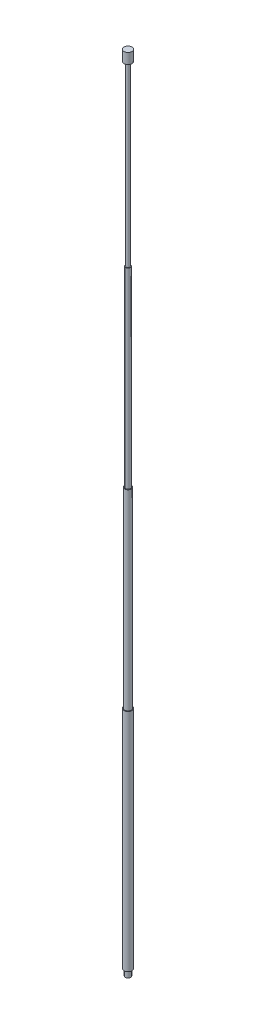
ISO-10303-21;
HEADER;
FILE_DESCRIPTION(('STEP AP214'),'2;1');
FILE_NAME('part.step','',(''),(''),'','','');
FILE_SCHEMA(('AUTOMOTIVE_DESIGN { 1 0 10303 214 1 1 1 1 }'));
ENDSEC;
DATA;
#1=APPLICATION_CONTEXT('core data for automotive mechanical design processes');
#2=APPLICATION_PROTOCOL_DEFINITION('international standard','automotive_design',2000,#1);
#3=PRODUCT_CONTEXT('',#1,'mechanical');
#4=PRODUCT('Part','Part','',(#3));
#5=PRODUCT_RELATED_PRODUCT_CATEGORY('part','',(#4));
#6=PRODUCT_DEFINITION_FORMATION('','',#4);
#7=PRODUCT_DEFINITION_CONTEXT('part definition',#1,'design');
#8=PRODUCT_DEFINITION('design','',#6,#7);
#9=PRODUCT_DEFINITION_SHAPE('','',#8);
#10=(LENGTH_UNIT() NAMED_UNIT(*) SI_UNIT(.MILLI.,.METRE.));
#11=(NAMED_UNIT(*) PLANE_ANGLE_UNIT() SI_UNIT($,.RADIAN.));
#12=(NAMED_UNIT(*) SI_UNIT($,.STERADIAN.) SOLID_ANGLE_UNIT());
#13=UNCERTAINTY_MEASURE_WITH_UNIT(LENGTH_MEASURE(1.E-05),#10,'distance_accuracy_value','');
#14=(GEOMETRIC_REPRESENTATION_CONTEXT(3) GLOBAL_UNCERTAINTY_ASSIGNED_CONTEXT((#13)) GLOBAL_UNIT_ASSIGNED_CONTEXT((#10,
#11,#12)) REPRESENTATION_CONTEXT('',''));
#15=CARTESIAN_POINT('',(0.,0.,0.));
#16=DIRECTION('',(0.,0.,1.));
#17=DIRECTION('',(1.,0.,0.));
#18=AXIS2_PLACEMENT_3D('',#15,#16,#17);
#19=CARTESIAN_POINT('',(0.,0.,0.));
#20=DIRECTION('',(0.,1.,0.));
#21=DIRECTION('',(0.,0.,1.));
#22=AXIS2_PLACEMENT_3D('',#19,#20,#21);
#23=PLANE('',#22);
#24=CARTESIAN_POINT('',(0.,0.,0.));
#25=DIRECTION('',(0.,1.,0.));
#26=DIRECTION('',(0.,0.,1.));
#27=AXIS2_PLACEMENT_3D('',#24,#25,#26);
#28=CIRCLE('',#27,2.125);
#29=CARTESIAN_POINT('',(0.,0.,2.125));
#30=VERTEX_POINT('',#29);
#31=EDGE_CURVE('E40',#30,#30,#28,.T.);
#32=ORIENTED_EDGE('',*,*,#31,.F.);
#33=EDGE_LOOP('',(#32));
#34=FACE_BOUND('',#33,.T.);
#35=CARTESIAN_POINT('',(0.,0.,0.));
#36=DIRECTION('',(0.,1.,0.));
#37=DIRECTION('',(0.,0.,1.));
#38=AXIS2_PLACEMENT_3D('',#35,#36,#37);
#39=CIRCLE('',#38,1.435);
#40=CARTESIAN_POINT('',(0.,0.,1.435));
#41=VERTEX_POINT('',#40);
#42=EDGE_CURVE('E10',#41,#41,#39,.F.);
#43=ORIENTED_EDGE('',*,*,#42,.F.);
#44=EDGE_LOOP('',(#43));
#45=FACE_BOUND('',#44,.T.);
#46=ADVANCED_FACE('F25',(#34,#45),#23,.F.);
#47=CARTESIAN_POINT('',(0.,424.,0.));
#48=DIRECTION('',(0.,-1.,0.));
#49=DIRECTION('',(0.,0.,-1.));
#50=AXIS2_PLACEMENT_3D('',#47,#48,#49);
#51=CYLINDRICAL_SURFACE('',#50,0.925);
#52=CARTESIAN_POINT('',(0.,324.,0.));
#53=DIRECTION('',(0.,1.,0.));
#54=DIRECTION('',(0.,0.,1.));
#55=AXIS2_PLACEMENT_3D('',#52,#53,#54);
#56=CIRCLE('',#55,0.925);
#57=CARTESIAN_POINT('',(0.,324.,0.925));
#58=VERTEX_POINT('',#57);
#59=EDGE_CURVE('E57',#58,#58,#56,.T.);
#60=ORIENTED_EDGE('',*,*,#59,.T.);
#61=EDGE_LOOP('',(#60));
#62=FACE_BOUND('',#61,.T.);
#63=CARTESIAN_POINT('',(0.,418.4,0.));
#64=DIRECTION('',(0.,1.,0.));
#65=DIRECTION('',(0.,0.,1.));
#66=AXIS2_PLACEMENT_3D('',#63,#64,#65);
#67=CIRCLE('',#66,0.925);
#68=CARTESIAN_POINT('',(0.,418.4,0.925));
#69=VERTEX_POINT('',#68);
#70=EDGE_CURVE('E32',#69,#69,#67,.T.);
#71=ORIENTED_EDGE('',*,*,#70,.F.);
#72=EDGE_LOOP('',(#71));
#73=FACE_BOUND('',#72,.T.);
#74=ADVANCED_FACE('F86',(#62,#73),#51,.T.);
#75=CARTESIAN_POINT('',(0.,324.,0.));
#76=DIRECTION('',(0.,1.,0.));
#77=DIRECTION('',(0.,0.,1.));
#78=AXIS2_PLACEMENT_3D('',#75,#76,#77);
#79=PLANE('',#78);
#80=CARTESIAN_POINT('',(0.,324.,0.));
#81=DIRECTION('',(0.,1.,0.));
#82=DIRECTION('',(0.,0.,1.));
#83=AXIS2_PLACEMENT_3D('',#80,#81,#82);
#84=CIRCLE('',#83,1.325);
#85=CARTESIAN_POINT('',(0.,324.,1.325));
#86=VERTEX_POINT('',#85);
#87=EDGE_CURVE('E51',#86,#86,#84,.T.);
#88=ORIENTED_EDGE('',*,*,#87,.T.);
#89=EDGE_LOOP('',(#88));
#90=FACE_BOUND('',#89,.T.);
#91=ORIENTED_EDGE('',*,*,#59,.F.);
#92=EDGE_LOOP('',(#91));
#93=FACE_BOUND('',#92,.T.);
#94=ADVANCED_FACE('F92',(#90,#93),#79,.T.);
#95=CARTESIAN_POINT('',(0.,222.,0.));
#96=DIRECTION('',(0.,1.,0.));
#97=DIRECTION('',(0.,0.,1.));
#98=AXIS2_PLACEMENT_3D('',#95,#96,#97);
#99=PLANE('',#98);
#100=CARTESIAN_POINT('',(0.,222.,0.));
#101=DIRECTION('',(0.,1.,0.));
#102=DIRECTION('',(0.,0.,1.));
#103=AXIS2_PLACEMENT_3D('',#100,#101,#102);
#104=CIRCLE('',#103,1.725);
#105=CARTESIAN_POINT('',(0.,222.,1.725));
#106=VERTEX_POINT('',#105);
#107=EDGE_CURVE('E45',#106,#106,#104,.T.);
#108=ORIENTED_EDGE('',*,*,#107,.T.);
#109=EDGE_LOOP('',(#108));
#110=FACE_BOUND('',#109,.T.);
#111=CARTESIAN_POINT('',(0.,222.,0.));
#112=DIRECTION('',(0.,1.,0.));
#113=DIRECTION('',(0.,0.,1.));
#114=AXIS2_PLACEMENT_3D('',#111,#112,#113);
#115=CIRCLE('',#114,1.325);
#116=CARTESIAN_POINT('',(0.,222.,1.325));
#117=VERTEX_POINT('',#116);
#118=EDGE_CURVE('E54',#117,#117,#115,.T.);
#119=ORIENTED_EDGE('',*,*,#118,.F.);
#120=EDGE_LOOP('',(#119));
#121=FACE_BOUND('',#120,.T.);
#122=ADVANCED_FACE('F102',(#110,#121),#99,.T.);
#123=CARTESIAN_POINT('',(0.,120.,0.));
#124=DIRECTION('',(0.,1.,0.));
#125=DIRECTION('',(0.,0.,1.));
#126=AXIS2_PLACEMENT_3D('',#123,#124,#125);
#127=PLANE('',#126);
#128=CARTESIAN_POINT('',(0.,120.,0.));
#129=DIRECTION('',(0.,1.,0.));
#130=DIRECTION('',(0.,0.,1.));
#131=AXIS2_PLACEMENT_3D('',#128,#129,#130);
#132=CIRCLE('',#131,2.125);
#133=CARTESIAN_POINT('',(0.,120.,2.125));
#134=VERTEX_POINT('',#133);
#135=EDGE_CURVE('E36',#134,#134,#132,.T.);
#136=ORIENTED_EDGE('',*,*,#135,.T.);
#137=EDGE_LOOP('',(#136));
#138=FACE_BOUND('',#137,.T.);
#139=CARTESIAN_POINT('',(0.,120.,0.));
#140=DIRECTION('',(0.,1.,0.));
#141=DIRECTION('',(0.,0.,1.));
#142=AXIS2_PLACEMENT_3D('',#139,#140,#141);
#143=CIRCLE('',#142,1.725);
#144=CARTESIAN_POINT('',(0.,120.,1.725));
#145=VERTEX_POINT('',#144);
#146=EDGE_CURVE('E48',#145,#145,#143,.T.);
#147=ORIENTED_EDGE('',*,*,#146,.F.);
#148=EDGE_LOOP('',(#147));
#149=FACE_BOUND('',#148,.T.);
#150=ADVANCED_FACE('F100',(#138,#149),#127,.T.);
#151=CARTESIAN_POINT('',(0.,120.,0.));
#152=DIRECTION('',(0.,-1.,0.));
#153=DIRECTION('',(0.,0.,-1.));
#154=AXIS2_PLACEMENT_3D('',#151,#152,#153);
#155=CYLINDRICAL_SURFACE('',#154,2.125);
#156=ORIENTED_EDGE('',*,*,#135,.F.);
#157=EDGE_LOOP('',(#156));
#158=FACE_BOUND('',#157,.T.);
#159=ORIENTED_EDGE('',*,*,#31,.T.);
#160=EDGE_LOOP('',(#159));
#161=FACE_BOUND('',#160,.T.);
#162=ADVANCED_FACE('F27',(#158,#161),#155,.T.);
#163=CARTESIAN_POINT('',(0.,222.,0.));
#164=DIRECTION('',(0.,-1.,0.));
#165=DIRECTION('',(0.,0.,-1.));
#166=AXIS2_PLACEMENT_3D('',#163,#164,#165);
#167=CYLINDRICAL_SURFACE('',#166,1.725);
#168=ORIENTED_EDGE('',*,*,#107,.F.);
#169=EDGE_LOOP('',(#168));
#170=FACE_BOUND('',#169,.T.);
#171=ORIENTED_EDGE('',*,*,#146,.T.);
#172=EDGE_LOOP('',(#171));
#173=FACE_BOUND('',#172,.T.);
#174=ADVANCED_FACE('F98',(#170,#173),#167,.T.);
#175=CARTESIAN_POINT('',(0.,324.,0.));
#176=DIRECTION('',(0.,-1.,0.));
#177=DIRECTION('',(0.,0.,-1.));
#178=AXIS2_PLACEMENT_3D('',#175,#176,#177);
#179=CYLINDRICAL_SURFACE('',#178,1.325);
#180=ORIENTED_EDGE('',*,*,#87,.F.);
#181=EDGE_LOOP('',(#180));
#182=FACE_BOUND('',#181,.T.);
#183=ORIENTED_EDGE('',*,*,#118,.T.);
#184=EDGE_LOOP('',(#183));
#185=FACE_BOUND('',#184,.T.);
#186=ADVANCED_FACE('F115',(#182,#185),#179,.T.);
#187=CARTESIAN_POINT('',(0.,418.4,0.));
#188=DIRECTION('',(0.,1.,0.));
#189=DIRECTION('',(0.,0.,1.));
#190=AXIS2_PLACEMENT_3D('',#187,#188,#189);
#191=PLANE('',#190);
#192=CARTESIAN_POINT('',(0.,418.4,0.));
#193=DIRECTION('',(0.,1.,0.));
#194=DIRECTION('',(0.,0.,1.));
#195=AXIS2_PLACEMENT_3D('',#192,#193,#194);
#196=CIRCLE('',#195,2.125);
#197=CARTESIAN_POINT('',(0.,418.4,2.125));
#198=VERTEX_POINT('',#197);
#199=EDGE_CURVE('E60',#198,#198,#196,.T.);
#200=ORIENTED_EDGE('',*,*,#199,.F.);
#201=EDGE_LOOP('',(#200));
#202=FACE_BOUND('',#201,.T.);
#203=ORIENTED_EDGE('',*,*,#70,.T.);
#204=EDGE_LOOP('',(#203));
#205=FACE_BOUND('',#204,.T.);
#206=ADVANCED_FACE('F120',(#202,#205),#191,.F.);
#207=CARTESIAN_POINT('',(0.,418.4,0.));
#208=DIRECTION('',(0.,1.,0.));
#209=DIRECTION('',(0.,0.,1.));
#210=AXIS2_PLACEMENT_3D('',#207,#208,#209);
#211=CYLINDRICAL_SURFACE('',#210,2.125);
#212=ORIENTED_EDGE('',*,*,#199,.T.);
#213=EDGE_LOOP('',(#212));
#214=FACE_BOUND('',#213,.T.);
#215=CARTESIAN_POINT('',(0.,424.,0.));
#216=DIRECTION('',(0.,1.,0.));
#217=DIRECTION('',(0.,0.,1.));
#218=AXIS2_PLACEMENT_3D('',#215,#216,#217);
#219=CIRCLE('',#218,2.125);
#220=CARTESIAN_POINT('',(0.,424.,2.125));
#221=VERTEX_POINT('',#220);
#222=EDGE_CURVE('E63',#221,#221,#219,.T.);
#223=ORIENTED_EDGE('',*,*,#222,.F.);
#224=EDGE_LOOP('',(#223));
#225=FACE_BOUND('',#224,.T.);
#226=ADVANCED_FACE('F82',(#214,#225),#211,.T.);
#227=CARTESIAN_POINT('',(0.,424.,0.));
#228=DIRECTION('',(0.,1.,0.));
#229=DIRECTION('',(0.,0.,1.));
#230=AXIS2_PLACEMENT_3D('',#227,#228,#229);
#231=PLANE('',#230);
#232=ORIENTED_EDGE('',*,*,#222,.T.);
#233=EDGE_LOOP('',(#232));
#234=FACE_BOUND('',#233,.T.);
#235=ADVANCED_FACE('F74',(#234),#231,.T.);
#236=CARTESIAN_POINT('',(0.,-3.4,0.));
#237=DIRECTION('',(0.,1.,0.));
#238=DIRECTION('',(0.,0.,1.));
#239=AXIS2_PLACEMENT_3D('',#236,#237,#238);
#240=CYLINDRICAL_SURFACE('',#239,1.435);
#241=CARTESIAN_POINT('',(0.,-3.4,0.));
#242=DIRECTION('',(0.,-1.,0.));
#243=DIRECTION('',(0.,0.,-1.));
#244=AXIS2_PLACEMENT_3D('',#241,#242,#243);
#245=CIRCLE('',#244,1.435);
#246=CARTESIAN_POINT('',(0.,-3.4,-1.435));
#247=VERTEX_POINT('',#246);
#248=EDGE_CURVE('E66',#247,#247,#245,.T.);
#249=ORIENTED_EDGE('',*,*,#248,.F.);
#250=EDGE_LOOP('',(#249));
#251=FACE_BOUND('',#250,.T.);
#252=ORIENTED_EDGE('',*,*,#42,.T.);
#253=EDGE_LOOP('',(#252));
#254=FACE_BOUND('',#253,.T.);
#255=ADVANCED_FACE('F72',(#251,#254),#240,.T.);
#256=CARTESIAN_POINT('',(0.,-3.4,0.));
#257=DIRECTION('',(0.,-1.,0.));
#258=DIRECTION('',(0.,0.,-1.));
#259=AXIS2_PLACEMENT_3D('',#256,#257,#258);
#260=PLANE('',#259);
#261=ORIENTED_EDGE('',*,*,#248,.T.);
#262=EDGE_LOOP('',(#261));
#263=FACE_BOUND('',#262,.T.);
#264=ADVANCED_FACE('F70',(#263),#260,.T.);
#265=CLOSED_SHELL('',(#46,#74,#94,#122,#150,#162,#174,#186,#206,#226,#235,#255,#264));
#266=MANIFOLD_SOLID_BREP('B2',#265);
#267=ADVANCED_BREP_SHAPE_REPRESENTATION('',(#18,#266),#14);
#268=SHAPE_DEFINITION_REPRESENTATION(#9,#267);
ENDSEC;
END-ISO-10303-21;
